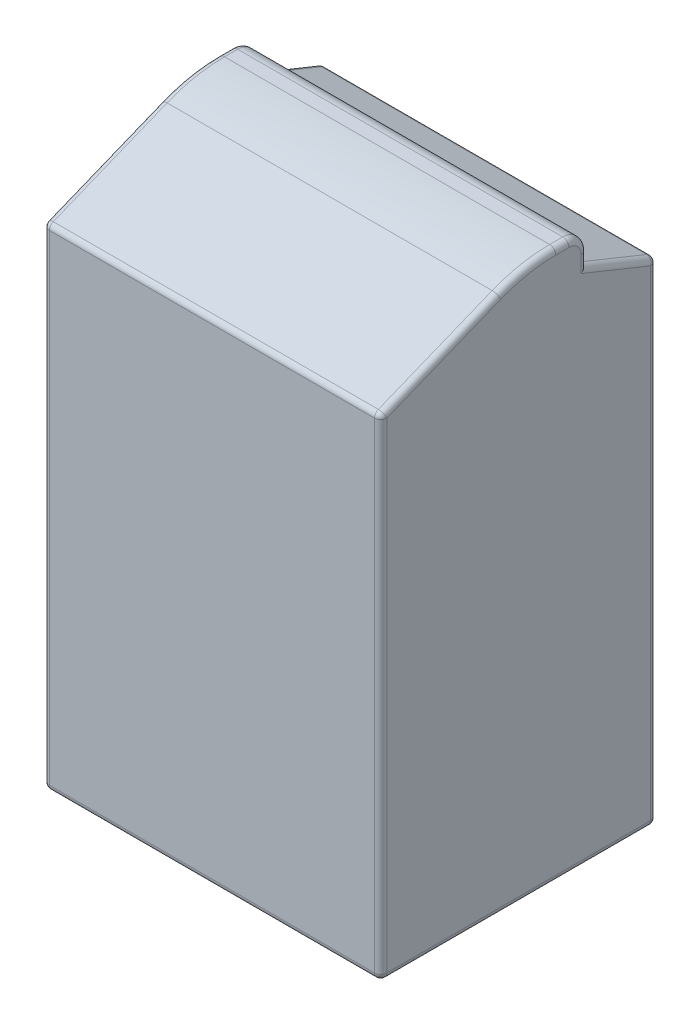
from build123d import *

# Parameters (mm, degrees)
BOSS_EXTRUDE1_DEPTH = 27.5
FILLET1_R           = 1


with BuildPart() as part:
    # Sketch1 → Boss-Extrude1 (new, symmetric)
    with BuildSketch(Plane(origin=(0, 0, 0), x_dir=(0, 0, -1), z_dir=(1, 0, 0))):
        with BuildLine():
            Line((-22.5, 80), (-3.317939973, 87.750055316))
            ThreePointArc((-3.317939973, 87.750055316), (1.276999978, 89.111138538), (6.047224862, 89.570458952))
            Line((6.047224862, 89.570458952), (8.187717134, 89.570458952))
            ThreePointArc((8.187717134, 89.570458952), (10.309037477, 88.691779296), (11.187717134, 86.570458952))
            Line((11.187717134, 86.570458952), (11.187717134, 84.570458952))
            Line((11.187717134, 84.570458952), (22.5, 80))
            Line((22.5, 80), (22.5, 0))
            Line((22.5, 0), (-22.5, 0))
            Line((-22.5, 0), (-22.5, 80))
        make_face()
    extrude(amount=BOSS_EXTRUDE1_DEPTH, both=True)

    # Fillet1
    fillet1_edges = [part.edges().sort_by_distance(p)[0] for p in [
        (-27.5, 89.570458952, -7.117470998),
        (-27.5, 88.691779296, -10.309037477),
        (-27.5, 85.570458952, -11.187717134),
        (-27.5, 82.285229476, -16.843858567),
        (-27.5, 40, -22.5),
        (-27.5, 0, 0),
        (-27.5, 40, 22.5),
        (27.5, 40, -22.5),
        (0, 80, 22.5),
        (0, 80, -22.5),
        (0, 0, -22.5),
        (0, 0, 22.5),
        (27.5, 82.285229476, -16.843858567),
        (27.5, 85.570458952, -11.187717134),
        (27.5, 88.691779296, -10.309037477),
        (27.5, 89.570458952, -7.117470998),
        (27.5, 89.111138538, -1.276999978),
        (27.5, 83.875027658, 12.908969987),
        (27.5, 40, 22.5),
        (27.5, 0, 0),
        (-27.5, 83.875027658, 12.908969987),
        (-27.5, 89.111138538, -1.276999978),
    ]]
    fillet(fillet1_edges, radius=FILLET1_R)


solid = part.part
